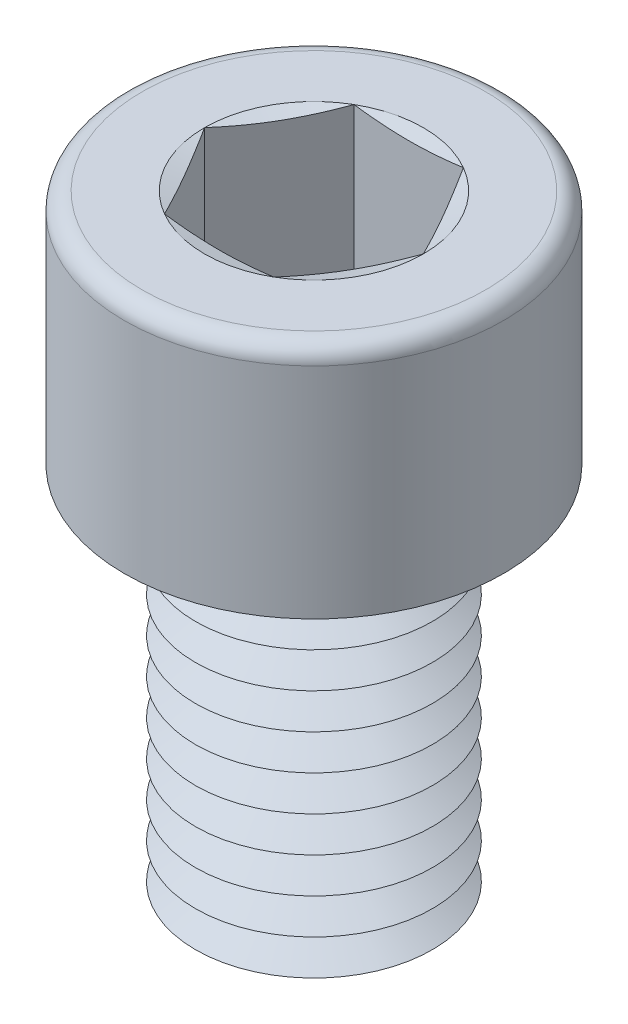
ISO-10303-21;
HEADER;
FILE_DESCRIPTION(('STEP AP214'),'2;1');
FILE_NAME('part.step','',(''),(''),'','','');
FILE_SCHEMA(('AUTOMOTIVE_DESIGN { 1 0 10303 214 1 1 1 1 }'));
ENDSEC;
DATA;
#1=APPLICATION_CONTEXT('core data for automotive mechanical design processes');
#2=APPLICATION_PROTOCOL_DEFINITION('international standard','automotive_design',2000,#1);
#3=PRODUCT_CONTEXT('',#1,'mechanical');
#4=PRODUCT('Part','Part','',(#3));
#5=PRODUCT_RELATED_PRODUCT_CATEGORY('part','',(#4));
#6=PRODUCT_DEFINITION_FORMATION('','',#4);
#7=PRODUCT_DEFINITION_CONTEXT('part definition',#1,'design');
#8=PRODUCT_DEFINITION('design','',#6,#7);
#9=PRODUCT_DEFINITION_SHAPE('','',#8);
#10=(LENGTH_UNIT() NAMED_UNIT(*) SI_UNIT(.MILLI.,.METRE.));
#11=(NAMED_UNIT(*) PLANE_ANGLE_UNIT() SI_UNIT($,.RADIAN.));
#12=(NAMED_UNIT(*) SI_UNIT($,.STERADIAN.) SOLID_ANGLE_UNIT());
#13=UNCERTAINTY_MEASURE_WITH_UNIT(LENGTH_MEASURE(1.E-05),#10,'distance_accuracy_value','');
#14=(GEOMETRIC_REPRESENTATION_CONTEXT(3) GLOBAL_UNCERTAINTY_ASSIGNED_CONTEXT((#13)) GLOBAL_UNIT_ASSIGNED_CONTEXT((#10,
#11,#12)) REPRESENTATION_CONTEXT('',''));
#15=CARTESIAN_POINT('',(0.,0.,0.));
#16=DIRECTION('',(0.,0.,1.));
#17=DIRECTION('',(1.,0.,0.));
#18=AXIS2_PLACEMENT_3D('',#15,#16,#17);
#19=CARTESIAN_POINT('',(0.,6.,0.));
#20=DIRECTION('',(0.,1.,0.));
#21=DIRECTION('',(0.,0.,1.));
#22=AXIS2_PLACEMENT_3D('',#19,#20,#21);
#23=CONICAL_SURFACE('',#22,3.70096189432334,1.0471975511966);
#24=CARTESIAN_POINT('',(0.,6.75,0.));
#25=DIRECTION('',(0.,1.,0.));
#26=DIRECTION('',(0.,0.,1.));
#27=AXIS2_PLACEMENT_3D('',#24,#25,#26);
#28=CIRCLE('',#27,5.);
#29=CARTESIAN_POINT('',(0.,6.75,5.));
#30=VERTEX_POINT('',#29);
#31=EDGE_CURVE('E399',#30,#30,#28,.T.);
#32=ORIENTED_EDGE('',*,*,#31,.F.);
#33=EDGE_LOOP('',(#32));
#34=FACE_BOUND('',#33,.T.);
#35=CARTESIAN_POINT('',(0.,6.,0.));
#36=DIRECTION('',(0.,1.,0.));
#37=DIRECTION('',(0.,0.,1.));
#38=AXIS2_PLACEMENT_3D('',#35,#36,#37);
#39=CIRCLE('',#38,3.70096189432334);
#40=CARTESIAN_POINT('',(0.,6.,3.70096189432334));
#41=VERTEX_POINT('',#40);
#42=EDGE_CURVE('E403',#41,#41,#39,.T.);
#43=ORIENTED_EDGE('',*,*,#42,.T.);
#44=EDGE_LOOP('',(#43));
#45=FACE_BOUND('',#44,.T.);
#46=ADVANCED_FACE('F41',(#34,#45),#23,.T.);
#47=CARTESIAN_POINT('',(0.,5.25,0.));
#48=DIRECTION('',(0.,-1.,0.));
#49=DIRECTION('',(0.,0.,-1.));
#50=AXIS2_PLACEMENT_3D('',#47,#48,#49);
#51=CONICAL_SURFACE('',#50,5.,1.0471975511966);
#52=ORIENTED_EDGE('',*,*,#42,.F.);
#53=EDGE_LOOP('',(#52));
#54=FACE_BOUND('',#53,.T.);
#55=CARTESIAN_POINT('',(0.,5.25,0.));
#56=DIRECTION('',(0.,1.,0.));
#57=DIRECTION('',(0.,0.,1.));
#58=AXIS2_PLACEMENT_3D('',#55,#56,#57);
#59=CIRCLE('',#58,5.);
#60=CARTESIAN_POINT('',(0.,5.25,5.));
#61=VERTEX_POINT('',#60);
#62=EDGE_CURVE('E407',#61,#61,#59,.T.);
#63=ORIENTED_EDGE('',*,*,#62,.T.);
#64=EDGE_LOOP('',(#63));
#65=FACE_BOUND('',#64,.T.);
#66=ADVANCED_FACE('F250',(#54,#65),#51,.T.);
#67=CARTESIAN_POINT('',(0.,0.,0.));
#68=DIRECTION('',(0.,1.,0.));
#69=DIRECTION('',(0.,0.,1.));
#70=AXIS2_PLACEMENT_3D('',#67,#68,#69);
#71=PLANE('',#70);
#72=CARTESIAN_POINT('',(0.,0.,0.));
#73=DIRECTION('',(0.,1.,0.));
#74=DIRECTION('',(0.,0.,1.));
#75=AXIS2_PLACEMENT_3D('',#72,#73,#74);
#76=CIRCLE('',#75,3.70096189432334);
#77=CARTESIAN_POINT('',(0.,0.,3.70096189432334));
#78=VERTEX_POINT('',#77);
#79=EDGE_CURVE('E434',#78,#78,#76,.T.);
#80=ORIENTED_EDGE('',*,*,#79,.F.);
#81=EDGE_LOOP('',(#80));
#82=FACE_BOUND('',#81,.T.);
#83=ADVANCED_FACE('F247',(#82),#71,.F.);
#84=CARTESIAN_POINT('',(0.,0.,0.));
#85=DIRECTION('',(0.,1.,0.));
#86=DIRECTION('',(0.,0.,1.));
#87=AXIS2_PLACEMENT_3D('',#84,#85,#86);
#88=CONICAL_SURFACE('',#87,3.70096189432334,1.0471975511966);
#89=CARTESIAN_POINT('',(0.,0.749999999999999,0.));
#90=DIRECTION('',(0.,1.,0.));
#91=DIRECTION('',(0.,0.,1.));
#92=AXIS2_PLACEMENT_3D('',#89,#90,#91);
#93=CIRCLE('',#92,5.);
#94=CARTESIAN_POINT('',(0.,0.749999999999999,5.));
#95=VERTEX_POINT('',#94);
#96=EDGE_CURVE('E430',#95,#95,#93,.T.);
#97=ORIENTED_EDGE('',*,*,#96,.F.);
#98=EDGE_LOOP('',(#97));
#99=FACE_BOUND('',#98,.T.);
#100=ORIENTED_EDGE('',*,*,#79,.T.);
#101=EDGE_LOOP('',(#100));
#102=FACE_BOUND('',#101,.T.);
#103=ADVANCED_FACE('F249',(#99,#102),#88,.T.);
#104=CARTESIAN_POINT('',(0.,0.749999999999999,0.));
#105=DIRECTION('',(0.,-1.,0.));
#106=DIRECTION('',(0.,0.,-1.));
#107=AXIS2_PLACEMENT_3D('',#104,#105,#106);
#108=CONICAL_SURFACE('',#107,5.,1.0471975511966);
#109=CARTESIAN_POINT('',(0.,1.5,0.));
#110=DIRECTION('',(0.,1.,0.));
#111=DIRECTION('',(0.,0.,1.));
#112=AXIS2_PLACEMENT_3D('',#109,#110,#111);
#113=CIRCLE('',#112,3.70096189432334);
#114=CARTESIAN_POINT('',(0.,1.5,3.70096189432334));
#115=VERTEX_POINT('',#114);
#116=EDGE_CURVE('E426',#115,#115,#113,.T.);
#117=ORIENTED_EDGE('',*,*,#116,.F.);
#118=EDGE_LOOP('',(#117));
#119=FACE_BOUND('',#118,.T.);
#120=ORIENTED_EDGE('',*,*,#96,.T.);
#121=EDGE_LOOP('',(#120));
#122=FACE_BOUND('',#121,.T.);
#123=ADVANCED_FACE('F290',(#119,#122),#108,.T.);
#124=CARTESIAN_POINT('',(0.,1.5,0.));
#125=DIRECTION('',(0.,1.,0.));
#126=DIRECTION('',(0.,0.,1.));
#127=AXIS2_PLACEMENT_3D('',#124,#125,#126);
#128=CONICAL_SURFACE('',#127,3.70096189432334,1.0471975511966);
#129=CARTESIAN_POINT('',(0.,2.25,0.));
#130=DIRECTION('',(0.,1.,0.));
#131=DIRECTION('',(0.,0.,1.));
#132=AXIS2_PLACEMENT_3D('',#129,#130,#131);
#133=CIRCLE('',#132,5.);
#134=CARTESIAN_POINT('',(0.,2.25,5.));
#135=VERTEX_POINT('',#134);
#136=EDGE_CURVE('E422',#135,#135,#133,.T.);
#137=ORIENTED_EDGE('',*,*,#136,.F.);
#138=EDGE_LOOP('',(#137));
#139=FACE_BOUND('',#138,.T.);
#140=ORIENTED_EDGE('',*,*,#116,.T.);
#141=EDGE_LOOP('',(#140));
#142=FACE_BOUND('',#141,.T.);
#143=ADVANCED_FACE('F285',(#139,#142),#128,.T.);
#144=CARTESIAN_POINT('',(0.,2.25,0.));
#145=DIRECTION('',(0.,-1.,0.));
#146=DIRECTION('',(0.,0.,-1.));
#147=AXIS2_PLACEMENT_3D('',#144,#145,#146);
#148=CONICAL_SURFACE('',#147,5.,1.0471975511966);
#149=CARTESIAN_POINT('',(0.,3.,0.));
#150=DIRECTION('',(0.,1.,0.));
#151=DIRECTION('',(0.,0.,1.));
#152=AXIS2_PLACEMENT_3D('',#149,#150,#151);
#153=CIRCLE('',#152,3.70096189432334);
#154=CARTESIAN_POINT('',(0.,3.,3.70096189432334));
#155=VERTEX_POINT('',#154);
#156=EDGE_CURVE('E418',#155,#155,#153,.T.);
#157=ORIENTED_EDGE('',*,*,#156,.F.);
#158=EDGE_LOOP('',(#157));
#159=FACE_BOUND('',#158,.T.);
#160=ORIENTED_EDGE('',*,*,#136,.T.);
#161=EDGE_LOOP('',(#160));
#162=FACE_BOUND('',#161,.T.);
#163=ADVANCED_FACE('F282',(#159,#162),#148,.T.);
#164=CARTESIAN_POINT('',(0.,3.,0.));
#165=DIRECTION('',(0.,1.,0.));
#166=DIRECTION('',(0.,0.,1.));
#167=AXIS2_PLACEMENT_3D('',#164,#165,#166);
#168=CONICAL_SURFACE('',#167,3.70096189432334,1.0471975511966);
#169=CARTESIAN_POINT('',(0.,3.75,0.));
#170=DIRECTION('',(0.,1.,0.));
#171=DIRECTION('',(0.,0.,1.));
#172=AXIS2_PLACEMENT_3D('',#169,#170,#171);
#173=CIRCLE('',#172,5.);
#174=CARTESIAN_POINT('',(0.,3.75,5.));
#175=VERTEX_POINT('',#174);
#176=EDGE_CURVE('E415',#175,#175,#173,.T.);
#177=ORIENTED_EDGE('',*,*,#176,.F.);
#178=EDGE_LOOP('',(#177));
#179=FACE_BOUND('',#178,.T.);
#180=ORIENTED_EDGE('',*,*,#156,.T.);
#181=EDGE_LOOP('',(#180));
#182=FACE_BOUND('',#181,.T.);
#183=ADVANCED_FACE('F276',(#179,#182),#168,.T.);
#184=CARTESIAN_POINT('',(0.,3.75,0.));
#185=DIRECTION('',(0.,-1.,0.));
#186=DIRECTION('',(0.,0.,-1.));
#187=AXIS2_PLACEMENT_3D('',#184,#185,#186);
#188=CONICAL_SURFACE('',#187,5.,1.0471975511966);
#189=CARTESIAN_POINT('',(0.,4.5,0.));
#190=DIRECTION('',(0.,1.,0.));
#191=DIRECTION('',(0.,0.,1.));
#192=AXIS2_PLACEMENT_3D('',#189,#190,#191);
#193=CIRCLE('',#192,3.70096189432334);
#194=CARTESIAN_POINT('',(0.,4.5,3.70096189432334));
#195=VERTEX_POINT('',#194);
#196=EDGE_CURVE('E411',#195,#195,#193,.T.);
#197=ORIENTED_EDGE('',*,*,#196,.F.);
#198=EDGE_LOOP('',(#197));
#199=FACE_BOUND('',#198,.T.);
#200=ORIENTED_EDGE('',*,*,#176,.T.);
#201=EDGE_LOOP('',(#200));
#202=FACE_BOUND('',#201,.T.);
#203=ADVANCED_FACE('F272',(#199,#202),#188,.T.);
#204=CARTESIAN_POINT('',(0.,4.5,0.));
#205=DIRECTION('',(0.,1.,0.));
#206=DIRECTION('',(0.,0.,1.));
#207=AXIS2_PLACEMENT_3D('',#204,#205,#206);
#208=CONICAL_SURFACE('',#207,3.70096189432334,1.0471975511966);
#209=ORIENTED_EDGE('',*,*,#62,.F.);
#210=EDGE_LOOP('',(#209));
#211=FACE_BOUND('',#210,.T.);
#212=ORIENTED_EDGE('',*,*,#196,.T.);
#213=EDGE_LOOP('',(#212));
#214=FACE_BOUND('',#213,.T.);
#215=ADVANCED_FACE('F275',(#211,#214),#208,.T.);
#216=CARTESIAN_POINT('',(0.,7.5,0.));
#217=DIRECTION('',(0.,1.,0.));
#218=DIRECTION('',(0.,0.,1.));
#219=AXIS2_PLACEMENT_3D('',#216,#217,#218);
#220=CONICAL_SURFACE('',#219,3.70096189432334,1.0471975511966);
#221=CARTESIAN_POINT('',(0.,8.25,0.));
#222=DIRECTION('',(0.,1.,0.));
#223=DIRECTION('',(0.,0.,1.));
#224=AXIS2_PLACEMENT_3D('',#221,#222,#223);
#225=CIRCLE('',#224,5.);
#226=CARTESIAN_POINT('',(0.,8.25,5.));
#227=VERTEX_POINT('',#226);
#228=EDGE_CURVE('E391',#227,#227,#225,.T.);
#229=ORIENTED_EDGE('',*,*,#228,.F.);
#230=EDGE_LOOP('',(#229));
#231=FACE_BOUND('',#230,.T.);
#232=CARTESIAN_POINT('',(0.,7.5,0.));
#233=DIRECTION('',(0.,1.,0.));
#234=DIRECTION('',(0.,0.,1.));
#235=AXIS2_PLACEMENT_3D('',#232,#233,#234);
#236=CIRCLE('',#235,3.70096189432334);
#237=CARTESIAN_POINT('',(0.,7.5,3.70096189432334));
#238=VERTEX_POINT('',#237);
#239=EDGE_CURVE('E395',#238,#238,#236,.T.);
#240=ORIENTED_EDGE('',*,*,#239,.T.);
#241=EDGE_LOOP('',(#240));
#242=FACE_BOUND('',#241,.T.);
#243=ADVANCED_FACE('F280',(#231,#242),#220,.T.);
#244=CARTESIAN_POINT('',(0.,6.75,0.));
#245=DIRECTION('',(0.,-1.,0.));
#246=DIRECTION('',(0.,0.,-1.));
#247=AXIS2_PLACEMENT_3D('',#244,#245,#246);
#248=CONICAL_SURFACE('',#247,5.,1.0471975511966);
#249=ORIENTED_EDGE('',*,*,#239,.F.);
#250=EDGE_LOOP('',(#249));
#251=FACE_BOUND('',#250,.T.);
#252=ORIENTED_EDGE('',*,*,#31,.T.);
#253=EDGE_LOOP('',(#252));
#254=FACE_BOUND('',#253,.T.);
#255=ADVANCED_FACE('F674',(#251,#254),#248,.T.);
#256=CARTESIAN_POINT('',(0.,9.,0.));
#257=DIRECTION('',(0.,1.,0.));
#258=DIRECTION('',(0.,0.,1.));
#259=AXIS2_PLACEMENT_3D('',#256,#257,#258);
#260=CONICAL_SURFACE('',#259,3.70096189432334,1.0471975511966);
#261=CARTESIAN_POINT('',(0.,9.75,0.));
#262=DIRECTION('',(0.,1.,0.));
#263=DIRECTION('',(0.,0.,1.));
#264=AXIS2_PLACEMENT_3D('',#261,#262,#263);
#265=CIRCLE('',#264,5.);
#266=CARTESIAN_POINT('',(0.,9.75,5.));
#267=VERTEX_POINT('',#266);
#268=EDGE_CURVE('E383',#267,#267,#265,.T.);
#269=ORIENTED_EDGE('',*,*,#268,.F.);
#270=EDGE_LOOP('',(#269));
#271=FACE_BOUND('',#270,.T.);
#272=CARTESIAN_POINT('',(0.,9.,0.));
#273=DIRECTION('',(0.,1.,0.));
#274=DIRECTION('',(0.,0.,1.));
#275=AXIS2_PLACEMENT_3D('',#272,#273,#274);
#276=CIRCLE('',#275,3.70096189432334);
#277=CARTESIAN_POINT('',(0.,9.,3.70096189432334));
#278=VERTEX_POINT('',#277);
#279=EDGE_CURVE('E387',#278,#278,#276,.T.);
#280=ORIENTED_EDGE('',*,*,#279,.T.);
#281=EDGE_LOOP('',(#280));
#282=FACE_BOUND('',#281,.T.);
#283=ADVANCED_FACE('F683',(#271,#282),#260,.T.);
#284=CARTESIAN_POINT('',(0.,8.25,0.));
#285=DIRECTION('',(0.,-1.,0.));
#286=DIRECTION('',(0.,0.,-1.));
#287=AXIS2_PLACEMENT_3D('',#284,#285,#286);
#288=CONICAL_SURFACE('',#287,5.,1.0471975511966);
#289=ORIENTED_EDGE('',*,*,#279,.F.);
#290=EDGE_LOOP('',(#289));
#291=FACE_BOUND('',#290,.T.);
#292=ORIENTED_EDGE('',*,*,#228,.T.);
#293=EDGE_LOOP('',(#292));
#294=FACE_BOUND('',#293,.T.);
#295=ADVANCED_FACE('F693',(#291,#294),#288,.T.);
#296=CARTESIAN_POINT('',(0.,10.5,0.));
#297=DIRECTION('',(0.,1.,0.));
#298=DIRECTION('',(0.,0.,1.));
#299=AXIS2_PLACEMENT_3D('',#296,#297,#298);
#300=CONICAL_SURFACE('',#299,3.70096189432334,1.0471975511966);
#301=CARTESIAN_POINT('',(0.,11.25,0.));
#302=DIRECTION('',(0.,1.,0.));
#303=DIRECTION('',(0.,0.,1.));
#304=AXIS2_PLACEMENT_3D('',#301,#302,#303);
#305=CIRCLE('',#304,5.);
#306=CARTESIAN_POINT('',(0.,11.25,5.));
#307=VERTEX_POINT('',#306);
#308=EDGE_CURVE('E375',#307,#307,#305,.T.);
#309=ORIENTED_EDGE('',*,*,#308,.F.);
#310=EDGE_LOOP('',(#309));
#311=FACE_BOUND('',#310,.T.);
#312=CARTESIAN_POINT('',(0.,10.5,0.));
#313=DIRECTION('',(0.,1.,0.));
#314=DIRECTION('',(0.,0.,1.));
#315=AXIS2_PLACEMENT_3D('',#312,#313,#314);
#316=CIRCLE('',#315,3.70096189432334);
#317=CARTESIAN_POINT('',(0.,10.5,3.70096189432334));
#318=VERTEX_POINT('',#317);
#319=EDGE_CURVE('E379',#318,#318,#316,.T.);
#320=ORIENTED_EDGE('',*,*,#319,.T.);
#321=EDGE_LOOP('',(#320));
#322=FACE_BOUND('',#321,.T.);
#323=ADVANCED_FACE('F703',(#311,#322),#300,.T.);
#324=CARTESIAN_POINT('',(0.,9.75,0.));
#325=DIRECTION('',(0.,-1.,0.));
#326=DIRECTION('',(0.,0.,-1.));
#327=AXIS2_PLACEMENT_3D('',#324,#325,#326);
#328=CONICAL_SURFACE('',#327,5.,1.0471975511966);
#329=ORIENTED_EDGE('',*,*,#319,.F.);
#330=EDGE_LOOP('',(#329));
#331=FACE_BOUND('',#330,.T.);
#332=ORIENTED_EDGE('',*,*,#268,.T.);
#333=EDGE_LOOP('',(#332));
#334=FACE_BOUND('',#333,.T.);
#335=ADVANCED_FACE('F713',(#331,#334),#328,.T.);
#336=CARTESIAN_POINT('',(0.,12.,0.));
#337=DIRECTION('',(0.,1.,0.));
#338=DIRECTION('',(0.,0.,1.));
#339=AXIS2_PLACEMENT_3D('',#336,#337,#338);
#340=CONICAL_SURFACE('',#339,3.70096189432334,1.0471975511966);
#341=CARTESIAN_POINT('',(0.,12.75,0.));
#342=DIRECTION('',(0.,1.,0.));
#343=DIRECTION('',(0.,0.,1.));
#344=AXIS2_PLACEMENT_3D('',#341,#342,#343);
#345=CIRCLE('',#344,5.);
#346=CARTESIAN_POINT('',(0.,12.75,5.));
#347=VERTEX_POINT('',#346);
#348=EDGE_CURVE('E367',#347,#347,#345,.T.);
#349=ORIENTED_EDGE('',*,*,#348,.F.);
#350=EDGE_LOOP('',(#349));
#351=FACE_BOUND('',#350,.T.);
#352=CARTESIAN_POINT('',(0.,12.,0.));
#353=DIRECTION('',(0.,1.,0.));
#354=DIRECTION('',(0.,0.,1.));
#355=AXIS2_PLACEMENT_3D('',#352,#353,#354);
#356=CIRCLE('',#355,3.70096189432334);
#357=CARTESIAN_POINT('',(0.,12.,3.70096189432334));
#358=VERTEX_POINT('',#357);
#359=EDGE_CURVE('E371',#358,#358,#356,.T.);
#360=ORIENTED_EDGE('',*,*,#359,.T.);
#361=EDGE_LOOP('',(#360));
#362=FACE_BOUND('',#361,.T.);
#363=ADVANCED_FACE('F723',(#351,#362),#340,.T.);
#364=CARTESIAN_POINT('',(0.,11.25,0.));
#365=DIRECTION('',(0.,-1.,0.));
#366=DIRECTION('',(0.,0.,-1.));
#367=AXIS2_PLACEMENT_3D('',#364,#365,#366);
#368=CONICAL_SURFACE('',#367,5.,1.0471975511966);
#369=ORIENTED_EDGE('',*,*,#359,.F.);
#370=EDGE_LOOP('',(#369));
#371=FACE_BOUND('',#370,.T.);
#372=ORIENTED_EDGE('',*,*,#308,.T.);
#373=EDGE_LOOP('',(#372));
#374=FACE_BOUND('',#373,.T.);
#375=ADVANCED_FACE('F733',(#371,#374),#368,.T.);
#376=CARTESIAN_POINT('',(0.,13.5,0.));
#377=DIRECTION('',(0.,1.,0.));
#378=DIRECTION('',(0.,0.,1.));
#379=AXIS2_PLACEMENT_3D('',#376,#377,#378);
#380=CONICAL_SURFACE('',#379,3.70096189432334,1.0471975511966);
#381=CARTESIAN_POINT('',(0.,14.25,0.));
#382=DIRECTION('',(0.,1.,0.));
#383=DIRECTION('',(0.,0.,1.));
#384=AXIS2_PLACEMENT_3D('',#381,#382,#383);
#385=CIRCLE('',#384,5.);
#386=CARTESIAN_POINT('',(0.,14.25,5.));
#387=VERTEX_POINT('',#386);
#388=EDGE_CURVE('E352',#387,#387,#385,.T.);
#389=ORIENTED_EDGE('',*,*,#388,.F.);
#390=EDGE_LOOP('',(#389));
#391=FACE_BOUND('',#390,.T.);
#392=CARTESIAN_POINT('',(0.,13.5,0.));
#393=DIRECTION('',(0.,1.,0.));
#394=DIRECTION('',(0.,0.,1.));
#395=AXIS2_PLACEMENT_3D('',#392,#393,#394);
#396=CIRCLE('',#395,3.70096189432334);
#397=CARTESIAN_POINT('',(0.,13.5,3.70096189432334));
#398=VERTEX_POINT('',#397);
#399=EDGE_CURVE('E363',#398,#398,#396,.T.);
#400=ORIENTED_EDGE('',*,*,#399,.T.);
#401=EDGE_LOOP('',(#400));
#402=FACE_BOUND('',#401,.T.);
#403=ADVANCED_FACE('F743',(#391,#402),#380,.T.);
#404=CARTESIAN_POINT('',(0.,12.75,0.));
#405=DIRECTION('',(0.,-1.,0.));
#406=DIRECTION('',(0.,0.,-1.));
#407=AXIS2_PLACEMENT_3D('',#404,#405,#406);
#408=CONICAL_SURFACE('',#407,5.,1.0471975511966);
#409=ORIENTED_EDGE('',*,*,#399,.F.);
#410=EDGE_LOOP('',(#409));
#411=FACE_BOUND('',#410,.T.);
#412=ORIENTED_EDGE('',*,*,#348,.T.);
#413=EDGE_LOOP('',(#412));
#414=FACE_BOUND('',#413,.T.);
#415=ADVANCED_FACE('F753',(#411,#414),#408,.T.);
#416=CARTESIAN_POINT('',(0.,15.,0.));
#417=DIRECTION('',(0.,1.,0.));
#418=DIRECTION('',(0.,0.,1.));
#419=AXIS2_PLACEMENT_3D('',#416,#417,#418);
#420=CONICAL_SURFACE('',#419,3.70096189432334,1.0471975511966);
#421=CARTESIAN_POINT('',(0.,15.75,0.));
#422=DIRECTION('',(0.,1.,0.));
#423=DIRECTION('',(0.,0.,1.));
#424=AXIS2_PLACEMENT_3D('',#421,#422,#423);
#425=CIRCLE('',#424,5.);
#426=CARTESIAN_POINT('',(0.,15.75,5.));
#427=VERTEX_POINT('',#426);
#428=EDGE_CURVE('E358',#427,#427,#425,.T.);
#429=ORIENTED_EDGE('',*,*,#428,.F.);
#430=EDGE_LOOP('',(#429));
#431=FACE_BOUND('',#430,.T.);
#432=CARTESIAN_POINT('',(0.,15.,0.));
#433=DIRECTION('',(0.,1.,0.));
#434=DIRECTION('',(0.,0.,1.));
#435=AXIS2_PLACEMENT_3D('',#432,#433,#434);
#436=CIRCLE('',#435,3.70096189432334);
#437=CARTESIAN_POINT('',(0.,15.,3.70096189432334));
#438=VERTEX_POINT('',#437);
#439=EDGE_CURVE('E347',#438,#438,#436,.T.);
#440=ORIENTED_EDGE('',*,*,#439,.T.);
#441=EDGE_LOOP('',(#440));
#442=FACE_BOUND('',#441,.T.);
#443=ADVANCED_FACE('F763',(#431,#442),#420,.T.);
#444=CARTESIAN_POINT('',(0.,14.25,0.));
#445=DIRECTION('',(0.,-1.,0.));
#446=DIRECTION('',(0.,0.,-1.));
#447=AXIS2_PLACEMENT_3D('',#444,#445,#446);
#448=CONICAL_SURFACE('',#447,5.,1.0471975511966);
#449=ORIENTED_EDGE('',*,*,#439,.F.);
#450=EDGE_LOOP('',(#449));
#451=FACE_BOUND('',#450,.T.);
#452=ORIENTED_EDGE('',*,*,#388,.T.);
#453=EDGE_LOOP('',(#452));
#454=FACE_BOUND('',#453,.T.);
#455=ADVANCED_FACE('F194',(#451,#454),#448,.T.);
#456=CARTESIAN_POINT('',(0.,26.,0.));
#457=DIRECTION('',(0.,1.,0.));
#458=DIRECTION('',(0.,0.,1.));
#459=AXIS2_PLACEMENT_3D('',#456,#457,#458);
#460=PLANE('',#459);
#461=CARTESIAN_POINT('',(0.,26.,0.));
#462=DIRECTION('',(0.,1.,0.));
#463=DIRECTION('',(0.,0.,1.));
#464=AXIS2_PLACEMENT_3D('',#461,#462,#463);
#465=CIRCLE('',#464,4.61880215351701);
#466=CARTESIAN_POINT('',(2.3094010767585,26.,4.));
#467=VERTEX_POINT('',#466);
#468=CARTESIAN_POINT('',(4.61880215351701,26.,0.));
#469=VERTEX_POINT('',#468);
#470=EDGE_CURVE('E121',#467,#469,#465,.T.);
#471=ORIENTED_EDGE('',*,*,#470,.F.);
#472=CARTESIAN_POINT('',(0.,26.,0.));
#473=DIRECTION('',(0.,1.,0.));
#474=DIRECTION('',(0.,0.,1.));
#475=AXIS2_PLACEMENT_3D('',#472,#473,#474);
#476=CIRCLE('',#475,4.61880215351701);
#477=CARTESIAN_POINT('',(-2.3094010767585,26.,4.));
#478=VERTEX_POINT('',#477);
#479=EDGE_CURVE('E45',#478,#467,#476,.T.);
#480=ORIENTED_EDGE('',*,*,#479,.F.);
#481=CARTESIAN_POINT('',(-4.61880215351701,26.,0.));
#482=VERTEX_POINT('',#481);
#483=EDGE_CURVE('E138',#482,#478,#476,.T.);
#484=ORIENTED_EDGE('',*,*,#483,.F.);
#485=CARTESIAN_POINT('',(-2.3094010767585,26.,-4.));
#486=VERTEX_POINT('',#485);
#487=EDGE_CURVE('E508',#486,#482,#476,.T.);
#488=ORIENTED_EDGE('',*,*,#487,.F.);
#489=CARTESIAN_POINT('',(2.3094010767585,26.,-4.));
#490=VERTEX_POINT('',#489);
#491=EDGE_CURVE('E51',#490,#486,#476,.T.);
#492=ORIENTED_EDGE('',*,*,#491,.F.);
#493=EDGE_CURVE('E11',#469,#490,#476,.T.);
#494=ORIENTED_EDGE('',*,*,#493,.F.);
#495=EDGE_LOOP('',(#471,#480,#484,#488,#492,#494));
#496=FACE_BOUND('',#495,.T.);
#497=CARTESIAN_POINT('',(0.,26.,0.));
#498=DIRECTION('',(0.,1.,0.));
#499=DIRECTION('',(0.,0.,1.));
#500=AXIS2_PLACEMENT_3D('',#497,#498,#499);
#501=CIRCLE('',#500,7.25);
#502=CARTESIAN_POINT('',(0.,26.,7.25));
#503=VERTEX_POINT('',#502);
#504=EDGE_CURVE('E477',#503,#503,#501,.T.);
#505=ORIENTED_EDGE('',*,*,#504,.T.);
#506=EDGE_LOOP('',(#505));
#507=FACE_BOUND('',#506,.T.);
#508=ADVANCED_FACE('F140',(#496,#507),#460,.T.);
#509=CARTESIAN_POINT('',(0.,25.25,0.));
#510=DIRECTION('',(0.,1.,0.));
#511=DIRECTION('',(0.,0.,1.));
#512=AXIS2_PLACEMENT_3D('',#509,#510,#511);
#513=TOROIDAL_SURFACE('',#512,7.25,0.75);
#514=CARTESIAN_POINT('',(0.,25.25,0.));
#515=DIRECTION('',(0.,1.,0.));
#516=DIRECTION('',(0.,0.,1.));
#517=AXIS2_PLACEMENT_3D('',#514,#515,#516);
#518=CIRCLE('',#517,8.);
#519=CARTESIAN_POINT('',(0.,25.25,8.));
#520=VERTEX_POINT('',#519);
#521=EDGE_CURVE('E481',#520,#520,#518,.F.);
#522=ORIENTED_EDGE('',*,*,#521,.F.);
#523=EDGE_LOOP('',(#522));
#524=FACE_BOUND('',#523,.T.);
#525=ORIENTED_EDGE('',*,*,#504,.F.);
#526=EDGE_LOOP('',(#525));
#527=FACE_BOUND('',#526,.T.);
#528=ADVANCED_FACE('F43',(#524,#527),#513,.T.);
#529=CARTESIAN_POINT('',(0.,26.,0.));
#530=DIRECTION('',(0.,-1.,0.));
#531=DIRECTION('',(0.,0.,-1.));
#532=AXIS2_PLACEMENT_3D('',#529,#530,#531);
#533=CYLINDRICAL_SURFACE('',#532,8.);
#534=ORIENTED_EDGE('',*,*,#521,.T.);
#535=EDGE_LOOP('',(#534));
#536=FACE_BOUND('',#535,.T.);
#537=CARTESIAN_POINT('',(0.,16.,0.));
#538=DIRECTION('',(0.,1.,0.));
#539=DIRECTION('',(0.,0.,1.));
#540=AXIS2_PLACEMENT_3D('',#537,#538,#539);
#541=CIRCLE('',#540,8.);
#542=CARTESIAN_POINT('',(0.,16.,8.));
#543=VERTEX_POINT('',#542);
#544=EDGE_CURVE('E465',#543,#543,#541,.T.);
#545=ORIENTED_EDGE('',*,*,#544,.T.);
#546=EDGE_LOOP('',(#545));
#547=FACE_BOUND('',#546,.T.);
#548=ADVANCED_FACE('F242',(#536,#547),#533,.T.);
#549=CARTESIAN_POINT('',(0.,16.,0.));
#550=DIRECTION('',(0.,1.,0.));
#551=DIRECTION('',(0.,0.,1.));
#552=AXIS2_PLACEMENT_3D('',#549,#550,#551);
#553=PLANE('',#552);
#554=ORIENTED_EDGE('',*,*,#544,.F.);
#555=EDGE_LOOP('',(#554));
#556=FACE_BOUND('',#555,.T.);
#557=CARTESIAN_POINT('',(0.,16.,0.));
#558=DIRECTION('',(0.,1.,0.));
#559=DIRECTION('',(0.,0.,1.));
#560=AXIS2_PLACEMENT_3D('',#557,#558,#559);
#561=CIRCLE('',#560,5.);
#562=CARTESIAN_POINT('',(0.,16.,5.));
#563=VERTEX_POINT('',#562);
#564=EDGE_CURVE('E473',#563,#563,#561,.T.);
#565=ORIENTED_EDGE('',*,*,#564,.T.);
#566=EDGE_LOOP('',(#565));
#567=FACE_BOUND('',#566,.T.);
#568=ADVANCED_FACE('F238',(#556,#567),#553,.F.);
#569=CARTESIAN_POINT('',(0.,16.,0.));
#570=DIRECTION('',(0.,-1.,0.));
#571=DIRECTION('',(0.,0.,-1.));
#572=AXIS2_PLACEMENT_3D('',#569,#570,#571);
#573=CYLINDRICAL_SURFACE('',#572,5.);
#574=ORIENTED_EDGE('',*,*,#428,.T.);
#575=EDGE_LOOP('',(#574));
#576=FACE_BOUND('',#575,.T.);
#577=ORIENTED_EDGE('',*,*,#564,.F.);
#578=EDGE_LOOP('',(#577));
#579=FACE_BOUND('',#578,.T.);
#580=ADVANCED_FACE('F241',(#576,#579),#573,.T.);
#581=CARTESIAN_POINT('',(0.,26.,0.));
#582=DIRECTION('',(0.,1.,0.));
#583=DIRECTION('',(0.,0.,1.));
#584=AXIS2_PLACEMENT_3D('',#581,#582,#583);
#585=CONICAL_SURFACE('',#584,4.61880215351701,1.30899693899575);
#586=ORIENTED_EDGE('',*,*,#479,.T.);
#587=CARTESIAN_POINT('',(-6.02881516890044,26.7010337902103,4.));
#588=CARTESIAN_POINT('',(-5.8481958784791,26.6607170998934,4.));
#589=CARTESIAN_POINT('',(-5.66746141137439,26.6209072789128,4.));
#590=CARTESIAN_POINT('',(-5.30570552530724,26.5425748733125,4.));
#591=CARTESIAN_POINT('',(-5.12468409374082,26.5040523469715,4.));
#592=CARTESIAN_POINT('',(-4.76212658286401,26.4285326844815,4.));
#593=CARTESIAN_POINT('',(-4.58059016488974,26.3915371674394,4.));
#594=CARTESIAN_POINT('',(-4.21713405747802,26.3194839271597,4.));
#595=CARTESIAN_POINT('',(-4.03521437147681,26.2844261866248,4.));
#596=CARTESIAN_POINT('',(-3.67250657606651,26.217001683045,4.));
#597=CARTESIAN_POINT('',(-3.49172236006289,26.1846141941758,4.));
#598=CARTESIAN_POINT('',(-3.12965653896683,26.1227577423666,4.));
#599=CARTESIAN_POINT('',(-2.94837492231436,26.093288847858,4.));
#600=CARTESIAN_POINT('',(-2.40374454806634,26.0102645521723,4.));
#601=CARTESIAN_POINT('',(-2.03952090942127,25.9620742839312,4.));
#602=CARTESIAN_POINT('',(-1.48950033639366,25.905182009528,4.));
#603=CARTESIAN_POINT('',(-1.30450135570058,25.8887355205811,4.));
#604=CARTESIAN_POINT('',(-0.93405305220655,25.861988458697,4.));
#605=CARTESIAN_POINT('',(-0.748603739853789,25.8516877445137,4.));
#606=CARTESIAN_POINT('',(-0.37752889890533,25.8378309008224,4.));
#607=CARTESIAN_POINT('',(-0.191903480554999,25.834271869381,4.));
#608=CARTESIAN_POINT('',(0.179350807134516,25.8341156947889,4.));
#609=CARTESIAN_POINT('',(0.364979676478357,25.8375185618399,4.));
#610=CARTESIAN_POINT('',(0.736742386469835,25.8510980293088,4.));
#611=CARTESIAN_POINT('',(0.922875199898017,25.8613021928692,4.));
#612=CARTESIAN_POINT('',(1.29469888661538,25.8879135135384,4.));
#613=CARTESIAN_POINT('',(1.48038973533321,25.9043210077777,4.));
#614=CARTESIAN_POINT('',(1.85132520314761,25.942529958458,4.));
#615=CARTESIAN_POINT('',(2.036569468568,25.9643347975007,4.));
#616=CARTESIAN_POINT('',(2.40646407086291,26.0124559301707,4.));
#617=CARTESIAN_POINT('',(2.59111440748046,26.0387722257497,4.));
#618=CARTESIAN_POINT('',(2.96467049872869,26.0958323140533,4.));
#619=CARTESIAN_POINT('',(3.15356118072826,26.1266739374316,4.));
#620=CARTESIAN_POINT('',(3.53080577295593,26.1914895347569,4.));
#621=CARTESIAN_POINT('',(3.71915966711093,26.225463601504,4.));
#622=CARTESIAN_POINT('',(4.2835627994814,26.331122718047,4.));
#623=CARTESIAN_POINT('',(4.65891157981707,26.4065379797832,4.));
#624=CARTESIAN_POINT('',(5.40835351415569,26.5637698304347,4.));
#625=CARTESIAN_POINT('',(5.78244627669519,26.6455882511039,4.));
#626=CARTESIAN_POINT('',(6.52968076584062,26.8134827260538,4.));
#627=CARTESIAN_POINT('',(6.90282246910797,26.8995588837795,4.));
#628=CARTESIAN_POINT('',(7.64386653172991,27.0735615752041,4.));
#629=CARTESIAN_POINT('',(8.01177724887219,27.1614526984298,4.));
#630=CARTESIAN_POINT('',(8.74711499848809,27.3392675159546,4.));
#631=CARTESIAN_POINT('',(9.11454201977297,27.4291912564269,4.));
#632=CARTESIAN_POINT('',(9.84851788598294,27.6103931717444,4.));
#633=CARTESIAN_POINT('',(10.2150672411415,27.7016692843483,4.));
#634=CARTESIAN_POINT('',(10.9478692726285,27.8853497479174,4.));
#635=CARTESIAN_POINT('',(11.3141219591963,27.977754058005,4.));
#636=CARTESIAN_POINT('',(11.6802738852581,28.0705515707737,4.));
#637=B_SPLINE_CURVE_WITH_KNOTS('',3,(#587,#588,#589,#590,#591,#592,#593,#594,#595,#596,#597,
#598,#599,#600,#601,#602,#603,#604,#605,#606,#607,#608,#609,#610,#611,#612,#613,#614,#615,#616,
#617,#618,#619,#620,#621,#622,#623,#624,#625,#626,#627,#628,#629,#630,#631,#632,#633,#634,#635,
#636),.UNSPECIFIED.,.F.,.F.,(4,2,2,2,2,2,2,2,2,2,2,2,2,2,2,2,2,2,2,2,2,2,2,2,4),(0.,
0.555194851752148,1.11041480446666,1.66620908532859,2.22199840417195,2.77296094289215,
3.32393639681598,4.42561440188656,4.98271716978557,5.5398071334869,6.09665724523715,
6.65350817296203,7.21262964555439,7.77178150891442,8.33128469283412,8.89078811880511,
9.46493123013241,10.0390913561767,11.1875388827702,12.3363161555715,13.4851213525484,
14.6199040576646,15.7547125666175,16.8879395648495,18.0211256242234),.UNSPECIFIED.);
#638=EDGE_CURVE('E127',#478,#467,#637,.T.);
#639=ORIENTED_EDGE('',*,*,#638,.F.);
#640=EDGE_LOOP('',(#586,#639));
#641=FACE_BOUND('',#640,.T.);
#642=ADVANCED_FACE('F132',(#641),#585,.F.);
#643=ORIENTED_EDGE('',*,*,#483,.T.);
#644=CARTESIAN_POINT('',(-4.61891762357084,26.0000309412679,-0.000199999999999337));
#645=CARTESIAN_POINT('',(-4.52300443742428,25.9743194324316,0.165926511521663));
#646=CARTESIAN_POINT('',(-4.42691734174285,25.9509775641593,0.332354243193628));
#647=CARTESIAN_POINT('',(-4.23440378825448,25.9099680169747,0.66579749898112));
#648=CARTESIAN_POINT('',(-4.13797720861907,25.8923026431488,0.832813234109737));
#649=CARTESIAN_POINT('',(-3.94536936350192,25.8636774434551,1.16641980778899));
#650=CARTESIAN_POINT('',(-3.84918940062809,25.8526834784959,1.33300839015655));
#651=CARTESIAN_POINT('',(-3.65670681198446,25.8379416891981,1.66639801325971));
#652=CARTESIAN_POINT('',(-3.5604042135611,25.8341924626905,1.83319900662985));
#653=CARTESIAN_POINT('',(-3.3677990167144,25.8341924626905,2.16680099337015));
#654=CARTESIAN_POINT('',(-3.27149641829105,25.8379416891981,2.33360198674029));
#655=CARTESIAN_POINT('',(-3.07901382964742,25.8526834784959,2.66699160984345));
#656=CARTESIAN_POINT('',(-2.98283386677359,25.8636774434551,2.83358019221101));
#657=CARTESIAN_POINT('',(-2.79022602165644,25.8923026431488,3.16718676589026));
#658=CARTESIAN_POINT('',(-2.69379944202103,25.9099680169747,3.33420250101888));
#659=CARTESIAN_POINT('',(-2.50128588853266,25.9509775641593,3.66764575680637));
#660=CARTESIAN_POINT('',(-2.40519879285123,25.9743194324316,3.83407348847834));
#661=CARTESIAN_POINT('',(-2.30928560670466,26.0000309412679,4.0002));
#662=B_SPLINE_CURVE_WITH_KNOTS('',3,(#644,#645,#646,#647,#648,#649,#650,#651,#652,#653,#654,
#655,#656,#657,#658,#659,#660,#661),.UNSPECIFIED.,.F.,.F.,(4,2,2,2,2,2,2,2,4),(0.,
0.580655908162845,1.1615473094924,1.73944052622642,2.31722188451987,2.89500324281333,
3.47289645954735,4.0537878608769,4.63444376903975),.UNSPECIFIED.);
#663=EDGE_CURVE('E163',#482,#478,#662,.T.);
#664=ORIENTED_EDGE('',*,*,#663,.F.);
#665=EDGE_LOOP('',(#643,#664));
#666=FACE_BOUND('',#665,.T.);
#667=ADVANCED_FACE('F257',(#666),#585,.F.);
#668=ORIENTED_EDGE('',*,*,#487,.T.);
#669=CARTESIAN_POINT('',(-2.30928560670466,26.0000309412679,-4.0002));
#670=CARTESIAN_POINT('',(-2.40519879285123,25.9743194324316,-3.83407348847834));
#671=CARTESIAN_POINT('',(-2.50128588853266,25.9509775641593,-3.66764575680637));
#672=CARTESIAN_POINT('',(-2.69379944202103,25.9099680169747,-3.33420250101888));
#673=CARTESIAN_POINT('',(-2.79022602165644,25.8923026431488,-3.16718676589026));
#674=CARTESIAN_POINT('',(-2.98283386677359,25.8636774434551,-2.83358019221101));
#675=CARTESIAN_POINT('',(-3.07901382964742,25.8526834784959,-2.66699160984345));
#676=CARTESIAN_POINT('',(-3.27149641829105,25.8379416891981,-2.33360198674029));
#677=CARTESIAN_POINT('',(-3.3677990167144,25.8341924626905,-2.16680099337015));
#678=CARTESIAN_POINT('',(-3.5604042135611,25.8341924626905,-1.83319900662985));
#679=CARTESIAN_POINT('',(-3.65670681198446,25.8379416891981,-1.66639801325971));
#680=CARTESIAN_POINT('',(-3.84918940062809,25.8526834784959,-1.33300839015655));
#681=CARTESIAN_POINT('',(-3.94536936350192,25.8636774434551,-1.16641980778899));
#682=CARTESIAN_POINT('',(-4.13797720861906,25.8923026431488,-0.832813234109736));
#683=CARTESIAN_POINT('',(-4.23440378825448,25.9099680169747,-0.66579749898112));
#684=CARTESIAN_POINT('',(-4.42691734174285,25.9509775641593,-0.332354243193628));
#685=CARTESIAN_POINT('',(-4.52300443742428,25.9743194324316,-0.165926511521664));
#686=CARTESIAN_POINT('',(-4.61891762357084,26.0000309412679,0.000199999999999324));
#687=B_SPLINE_CURVE_WITH_KNOTS('',3,(#669,#670,#671,#672,#673,#674,#675,#676,#677,#678,#679,
#680,#681,#682,#683,#684,#685,#686),.UNSPECIFIED.,.F.,.F.,(4,2,2,2,2,2,2,2,4),(0.,
0.580655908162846,1.1615473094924,1.73944052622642,2.31722188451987,2.89500324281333,
3.47289645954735,4.0537878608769,4.63444376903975),.UNSPECIFIED.);
#688=EDGE_CURVE('E63',#486,#482,#687,.T.);
#689=ORIENTED_EDGE('',*,*,#688,.F.);
#690=EDGE_LOOP('',(#668,#689));
#691=FACE_BOUND('',#690,.T.);
#692=ADVANCED_FACE('F192',(#691),#585,.F.);
#693=ORIENTED_EDGE('',*,*,#491,.T.);
#694=CARTESIAN_POINT('',(-6.02881516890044,26.7010337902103,-4.));
#695=CARTESIAN_POINT('',(-5.8481958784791,26.6607170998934,-4.));
#696=CARTESIAN_POINT('',(-5.66746141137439,26.6209072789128,-4.));
#697=CARTESIAN_POINT('',(-5.30570552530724,26.5425748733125,-4.));
#698=CARTESIAN_POINT('',(-5.12468409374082,26.5040523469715,-4.));
#699=CARTESIAN_POINT('',(-4.76212658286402,26.4285326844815,-4.));
#700=CARTESIAN_POINT('',(-4.58059016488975,26.3915371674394,-4.));
#701=CARTESIAN_POINT('',(-4.21713405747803,26.3194839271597,-4.));
#702=CARTESIAN_POINT('',(-4.03521437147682,26.2844261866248,-4.));
#703=CARTESIAN_POINT('',(-3.67250657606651,26.217001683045,-4.));
#704=CARTESIAN_POINT('',(-3.49172236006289,26.1846141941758,-4.));
#705=CARTESIAN_POINT('',(-3.12965653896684,26.1227577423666,-4.));
#706=CARTESIAN_POINT('',(-2.94837492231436,26.093288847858,-4.));
#707=CARTESIAN_POINT('',(-2.40374454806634,26.0102645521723,-4.));
#708=CARTESIAN_POINT('',(-2.03952090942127,25.9620742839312,-4.));
#709=CARTESIAN_POINT('',(-1.48950033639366,25.905182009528,-4.));
#710=CARTESIAN_POINT('',(-1.30450135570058,25.8887355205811,-4.));
#711=CARTESIAN_POINT('',(-0.93405305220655,25.861988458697,-4.));
#712=CARTESIAN_POINT('',(-0.748603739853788,25.8516877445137,-4.));
#713=CARTESIAN_POINT('',(-0.377528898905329,25.8378309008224,-4.));
#714=CARTESIAN_POINT('',(-0.191903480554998,25.834271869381,-4.));
#715=CARTESIAN_POINT('',(0.179350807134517,25.8341156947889,-4.));
#716=CARTESIAN_POINT('',(0.364979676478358,25.8375185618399,-4.));
#717=CARTESIAN_POINT('',(0.736742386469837,25.8510980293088,-4.));
#718=CARTESIAN_POINT('',(0.922875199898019,25.8613021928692,-4.));
#719=CARTESIAN_POINT('',(1.29469888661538,25.8879135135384,-4.));
#720=CARTESIAN_POINT('',(1.48038973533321,25.9043210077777,-4.));
#721=CARTESIAN_POINT('',(1.85132520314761,25.942529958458,-4.));
#722=CARTESIAN_POINT('',(2.036569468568,25.9643347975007,-4.));
#723=CARTESIAN_POINT('',(2.40646407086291,26.0124559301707,-4.));
#724=CARTESIAN_POINT('',(2.59111440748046,26.0387722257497,-4.));
#725=CARTESIAN_POINT('',(2.96467049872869,26.0958323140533,-4.));
#726=CARTESIAN_POINT('',(3.15356118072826,26.1266739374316,-4.));
#727=CARTESIAN_POINT('',(3.53080577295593,26.1914895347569,-4.));
#728=CARTESIAN_POINT('',(3.71915966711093,26.225463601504,-4.));
#729=CARTESIAN_POINT('',(4.2835627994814,26.331122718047,-4.));
#730=CARTESIAN_POINT('',(4.65891157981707,26.4065379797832,-4.));
#731=CARTESIAN_POINT('',(5.40835351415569,26.5637698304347,-4.));
#732=CARTESIAN_POINT('',(5.78244627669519,26.6455882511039,-4.));
#733=CARTESIAN_POINT('',(6.52968076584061,26.8134827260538,-4.));
#734=CARTESIAN_POINT('',(6.90282246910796,26.8995588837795,-4.));
#735=CARTESIAN_POINT('',(7.6438665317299,27.0735615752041,-4.));
#736=CARTESIAN_POINT('',(8.01177724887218,27.1614526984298,-4.));
#737=CARTESIAN_POINT('',(8.74711499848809,27.3392675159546,-4.));
#738=CARTESIAN_POINT('',(9.11454201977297,27.4291912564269,-4.));
#739=CARTESIAN_POINT('',(9.84851788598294,27.6103931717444,-4.));
#740=CARTESIAN_POINT('',(10.2150672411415,27.7016692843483,-4.));
#741=CARTESIAN_POINT('',(10.9478692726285,27.8853497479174,-4.));
#742=CARTESIAN_POINT('',(11.3141219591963,27.977754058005,-4.));
#743=CARTESIAN_POINT('',(11.6802738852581,28.0705515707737,-4.));
#744=B_SPLINE_CURVE_WITH_KNOTS('',3,(#694,#695,#696,#697,#698,#699,#700,#701,#702,#703,#704,
#705,#706,#707,#708,#709,#710,#711,#712,#713,#714,#715,#716,#717,#718,#719,#720,#721,#722,#723,
#724,#725,#726,#727,#728,#729,#730,#731,#732,#733,#734,#735,#736,#737,#738,#739,#740,#741,#742,
#743),.UNSPECIFIED.,.F.,.F.,(4,2,2,2,2,2,2,2,2,2,2,2,2,2,2,2,2,2,2,2,2,2,2,2,4),(0.,
0.555194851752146,1.11041480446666,1.66620908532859,2.22199840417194,2.77296094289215,
3.32393639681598,4.42561440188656,4.98271716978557,5.5398071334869,6.09665724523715,
6.65350817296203,7.21262964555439,7.77178150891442,8.33128469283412,8.89078811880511,
9.46493123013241,10.0390913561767,11.1875388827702,12.3363161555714,13.4851213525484,
14.6199040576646,15.7547125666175,16.8879395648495,18.0211256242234),.UNSPECIFIED.);
#745=EDGE_CURVE('E213',#490,#486,#744,.F.);
#746=ORIENTED_EDGE('',*,*,#745,.F.);
#747=EDGE_LOOP('',(#693,#746));
#748=FACE_BOUND('',#747,.T.);
#749=ADVANCED_FACE('F187',(#748),#585,.F.);
#750=ORIENTED_EDGE('',*,*,#493,.T.);
#751=CARTESIAN_POINT('',(4.61891762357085,26.0000309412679,0.000199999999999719));
#752=CARTESIAN_POINT('',(4.52300443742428,25.9743194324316,-0.165926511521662));
#753=CARTESIAN_POINT('',(4.42691734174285,25.9509775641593,-0.332354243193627));
#754=CARTESIAN_POINT('',(4.23440378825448,25.9099680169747,-0.66579749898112));
#755=CARTESIAN_POINT('',(4.13797720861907,25.8923026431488,-0.832813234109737));
#756=CARTESIAN_POINT('',(3.94536936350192,25.8636774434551,-1.16641980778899));
#757=CARTESIAN_POINT('',(3.84918940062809,25.8526834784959,-1.33300839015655));
#758=CARTESIAN_POINT('',(3.65670681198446,25.8379416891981,-1.66639801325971));
#759=CARTESIAN_POINT('',(3.56040421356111,25.8341924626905,-1.83319900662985));
#760=CARTESIAN_POINT('',(3.3677990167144,25.8341924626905,-2.16680099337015));
#761=CARTESIAN_POINT('',(3.27149641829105,25.8379416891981,-2.33360198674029));
#762=CARTESIAN_POINT('',(3.07901382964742,25.8526834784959,-2.66699160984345));
#763=CARTESIAN_POINT('',(2.98283386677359,25.8636774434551,-2.83358019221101));
#764=CARTESIAN_POINT('',(2.79022602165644,25.8923026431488,-3.16718676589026));
#765=CARTESIAN_POINT('',(2.69379944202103,25.9099680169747,-3.33420250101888));
#766=CARTESIAN_POINT('',(2.50128588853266,25.9509775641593,-3.66764575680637));
#767=CARTESIAN_POINT('',(2.40519879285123,25.9743194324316,-3.83407348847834));
#768=CARTESIAN_POINT('',(2.30928560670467,26.0000309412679,-4.0002));
#769=B_SPLINE_CURVE_WITH_KNOTS('',3,(#751,#752,#753,#754,#755,#756,#757,#758,#759,#760,#761,
#762,#763,#764,#765,#766,#767,#768),.UNSPECIFIED.,.F.,.F.,(4,2,2,2,2,2,2,2,4),(0.,
0.580655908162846,1.1615473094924,1.73944052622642,2.31722188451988,2.89500324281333,
3.47289645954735,4.0537878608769,4.63444376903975),.UNSPECIFIED.);
#770=EDGE_CURVE('E56',#469,#490,#769,.T.);
#771=ORIENTED_EDGE('',*,*,#770,.F.);
#772=EDGE_LOOP('',(#750,#771));
#773=FACE_BOUND('',#772,.T.);
#774=ADVANCED_FACE('F191',(#773),#585,.F.);
#775=ORIENTED_EDGE('',*,*,#470,.T.);
#776=CARTESIAN_POINT('',(2.30928560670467,26.0000309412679,4.0002));
#777=CARTESIAN_POINT('',(2.40519879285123,25.9743194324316,3.83407348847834));
#778=CARTESIAN_POINT('',(2.50128588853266,25.9509775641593,3.66764575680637));
#779=CARTESIAN_POINT('',(2.69379944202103,25.9099680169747,3.33420250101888));
#780=CARTESIAN_POINT('',(2.79022602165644,25.8923026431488,3.16718676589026));
#781=CARTESIAN_POINT('',(2.98283386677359,25.8636774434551,2.83358019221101));
#782=CARTESIAN_POINT('',(3.07901382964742,25.8526834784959,2.66699160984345));
#783=CARTESIAN_POINT('',(3.27149641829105,25.8379416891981,2.33360198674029));
#784=CARTESIAN_POINT('',(3.36779901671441,25.8341924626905,2.16680099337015));
#785=CARTESIAN_POINT('',(3.56040421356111,25.8341924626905,1.83319900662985));
#786=CARTESIAN_POINT('',(3.65670681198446,25.8379416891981,1.66639801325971));
#787=CARTESIAN_POINT('',(3.84918940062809,25.8526834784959,1.33300839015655));
#788=CARTESIAN_POINT('',(3.94536936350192,25.8636774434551,1.16641980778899));
#789=CARTESIAN_POINT('',(4.13797720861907,25.8923026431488,0.832813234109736));
#790=CARTESIAN_POINT('',(4.23440378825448,25.9099680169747,0.665797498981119));
#791=CARTESIAN_POINT('',(4.42691734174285,25.9509775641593,0.332354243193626));
#792=CARTESIAN_POINT('',(4.52300443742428,25.9743194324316,0.165926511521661));
#793=CARTESIAN_POINT('',(4.61891762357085,26.0000309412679,-0.000200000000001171));
#794=B_SPLINE_CURVE_WITH_KNOTS('',3,(#776,#777,#778,#779,#780,#781,#782,#783,#784,#785,#786,
#787,#788,#789,#790,#791,#792,#793),.UNSPECIFIED.,.F.,.F.,(4,2,2,2,2,2,2,2,4),(0.,
0.580655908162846,1.1615473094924,1.73944052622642,2.31722188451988,2.89500324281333,
3.47289645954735,4.05378786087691,4.63444376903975),.UNSPECIFIED.);
#795=EDGE_CURVE('E117',#467,#469,#794,.T.);
#796=ORIENTED_EDGE('',*,*,#795,.F.);
#797=EDGE_LOOP('',(#775,#796));
#798=FACE_BOUND('',#797,.T.);
#799=ADVANCED_FACE('F119',(#798),#585,.F.);
#800=CARTESIAN_POINT('',(0.,18.,0.));
#801=DIRECTION('',(0.,1.,0.));
#802=DIRECTION('',(0.,0.,1.));
#803=AXIS2_PLACEMENT_3D('',#800,#801,#802);
#804=CONICAL_SURFACE('',#803,4.,1.0471975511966);
#805=CARTESIAN_POINT('',(0.,15.6905989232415,0.));
#806=VERTEX_POINT('',#805);
#807=VERTEX_LOOP('',#806);
#808=FACE_BOUND('',#807,.T.);
#809=CARTESIAN_POINT('',(0.,18.,0.));
#810=DIRECTION('',(0.,1.,0.));
#811=DIRECTION('',(0.,0.,1.));
#812=AXIS2_PLACEMENT_3D('',#809,#810,#811);
#813=CIRCLE('',#812,4.);
#814=CARTESIAN_POINT('',(0.,18.,4.));
#815=VERTEX_POINT('',#814);
#816=CARTESIAN_POINT('',(3.46410161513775,18.,2.));
#817=VERTEX_POINT('',#816);
#818=EDGE_CURVE('E438',#815,#817,#813,.T.);
#819=ORIENTED_EDGE('',*,*,#818,.T.);
#820=CARTESIAN_POINT('',(0.,18.,0.));
#821=DIRECTION('',(0.,1.,0.));
#822=DIRECTION('',(0.,0.,1.));
#823=AXIS2_PLACEMENT_3D('',#820,#821,#822);
#824=CIRCLE('',#823,4.);
#825=CARTESIAN_POINT('',(3.46410161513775,18.,-2.));
#826=VERTEX_POINT('',#825);
#827=EDGE_CURVE('E139',#817,#826,#824,.T.);
#828=ORIENTED_EDGE('',*,*,#827,.T.);
#829=CARTESIAN_POINT('',(0.,18.,-4.));
#830=VERTEX_POINT('',#829);
#831=EDGE_CURVE('E493',#826,#830,#824,.T.);
#832=ORIENTED_EDGE('',*,*,#831,.T.);
#833=CARTESIAN_POINT('',(-3.46410161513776,18.,-2.));
#834=VERTEX_POINT('',#833);
#835=EDGE_CURVE('E491',#830,#834,#824,.T.);
#836=ORIENTED_EDGE('',*,*,#835,.T.);
#837=CARTESIAN_POINT('',(-3.46410161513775,18.,2.));
#838=VERTEX_POINT('',#837);
#839=EDGE_CURVE('E486',#834,#838,#824,.T.);
#840=ORIENTED_EDGE('',*,*,#839,.T.);
#841=EDGE_CURVE('E484',#838,#815,#824,.T.);
#842=ORIENTED_EDGE('',*,*,#841,.T.);
#843=EDGE_LOOP('',(#819,#828,#832,#836,#840,#842));
#844=FACE_BOUND('',#843,.T.);
#845=ADVANCED_FACE('F300',(#808,#844),#804,.F.);
#846=CARTESIAN_POINT('',(2.3094010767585,18.,-4.));
#847=DIRECTION('',(0.,1.,0.));
#848=DIRECTION('',(0.,0.,1.));
#849=AXIS2_PLACEMENT_3D('',#846,#847,#848);
#850=PLANE('',#849);
#851=ORIENTED_EDGE('',*,*,#835,.F.);
#852=DIRECTION('',(-1.,0.,0.));
#853=VECTOR('',#852,1.);
#854=CARTESIAN_POINT('',(2.3094010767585,18.,-4.));
#855=LINE('',#854,#853);
#856=CARTESIAN_POINT('',(-2.3094010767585,18.,-4.));
#857=VERTEX_POINT('',#856);
#858=EDGE_CURVE('E446',#830,#857,#855,.T.);
#859=ORIENTED_EDGE('',*,*,#858,.T.);
#860=DIRECTION('',(-0.5,0.,0.866025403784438));
#861=VECTOR('',#860,1.);
#862=CARTESIAN_POINT('',(-2.3094010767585,18.,-4.));
#863=LINE('',#862,#861);
#864=EDGE_CURVE('E337',#857,#834,#863,.T.);
#865=ORIENTED_EDGE('',*,*,#864,.T.);
#866=EDGE_LOOP('',(#851,#859,#865));
#867=FACE_BOUND('',#866,.T.);
#868=ADVANCED_FACE('F303',(#867),#850,.T.);
#869=ORIENTED_EDGE('',*,*,#839,.F.);
#870=CARTESIAN_POINT('',(-4.618802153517,18.,0.));
#871=VERTEX_POINT('',#870);
#872=EDGE_CURVE('E451',#834,#871,#863,.T.);
#873=ORIENTED_EDGE('',*,*,#872,.T.);
#874=DIRECTION('',(0.5,0.,0.866025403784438));
#875=VECTOR('',#874,1.);
#876=CARTESIAN_POINT('',(-4.618802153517,18.,0.));
#877=LINE('',#876,#875);
#878=EDGE_CURVE('E327',#871,#838,#877,.T.);
#879=ORIENTED_EDGE('',*,*,#878,.T.);
#880=EDGE_LOOP('',(#869,#873,#879));
#881=FACE_BOUND('',#880,.T.);
#882=ADVANCED_FACE('F308',(#881),#850,.T.);
#883=ORIENTED_EDGE('',*,*,#841,.F.);
#884=CARTESIAN_POINT('',(-2.3094010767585,18.,4.));
#885=VERTEX_POINT('',#884);
#886=EDGE_CURVE('E453',#838,#885,#877,.T.);
#887=ORIENTED_EDGE('',*,*,#886,.T.);
#888=DIRECTION('',(1.,0.,0.));
#889=VECTOR('',#888,1.);
#890=CARTESIAN_POINT('',(-2.3094010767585,18.,4.));
#891=LINE('',#890,#889);
#892=EDGE_CURVE('E457',#885,#815,#891,.T.);
#893=ORIENTED_EDGE('',*,*,#892,.T.);
#894=EDGE_LOOP('',(#883,#887,#893));
#895=FACE_BOUND('',#894,.T.);
#896=ADVANCED_FACE('F305',(#895),#850,.T.);
#897=ORIENTED_EDGE('',*,*,#818,.F.);
#898=CARTESIAN_POINT('',(2.3094010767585,18.,4.));
#899=VERTEX_POINT('',#898);
#900=EDGE_CURVE('E456',#815,#899,#891,.T.);
#901=ORIENTED_EDGE('',*,*,#900,.T.);
#902=DIRECTION('',(0.5,0.,-0.866025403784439));
#903=VECTOR('',#902,1.);
#904=CARTESIAN_POINT('',(2.3094010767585,18.,4.));
#905=LINE('',#904,#903);
#906=EDGE_CURVE('E151',#899,#817,#905,.T.);
#907=ORIENTED_EDGE('',*,*,#906,.T.);
#908=EDGE_LOOP('',(#897,#901,#907));
#909=FACE_BOUND('',#908,.T.);
#910=ADVANCED_FACE('F307',(#909),#850,.T.);
#911=ORIENTED_EDGE('',*,*,#827,.F.);
#912=CARTESIAN_POINT('',(4.61880215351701,18.,0.));
#913=VERTEX_POINT('',#912);
#914=EDGE_CURVE('E461',#817,#913,#905,.T.);
#915=ORIENTED_EDGE('',*,*,#914,.T.);
#916=DIRECTION('',(-0.5,0.,-0.866025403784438));
#917=VECTOR('',#916,1.);
#918=CARTESIAN_POINT('',(4.61880215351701,18.,0.));
#919=LINE('',#918,#917);
#920=EDGE_CURVE('E442',#913,#826,#919,.T.);
#921=ORIENTED_EDGE('',*,*,#920,.T.);
#922=EDGE_LOOP('',(#911,#915,#921));
#923=FACE_BOUND('',#922,.T.);
#924=ADVANCED_FACE('F538',(#923),#850,.T.);
#925=ORIENTED_EDGE('',*,*,#831,.F.);
#926=CARTESIAN_POINT('',(2.3094010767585,18.,-4.));
#927=VERTEX_POINT('',#926);
#928=EDGE_CURVE('E441',#826,#927,#919,.T.);
#929=ORIENTED_EDGE('',*,*,#928,.T.);
#930=EDGE_CURVE('E447',#927,#830,#855,.T.);
#931=ORIENTED_EDGE('',*,*,#930,.T.);
#932=EDGE_LOOP('',(#925,#929,#931));
#933=FACE_BOUND('',#932,.T.);
#934=ADVANCED_FACE('F234',(#933),#850,.T.);
#935=CARTESIAN_POINT('',(4.61880215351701,18.,0.));
#936=DIRECTION('',(0.866025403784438,0.,-0.5));
#937=DIRECTION('',(-0.5,0.,-0.866025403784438));
#938=AXIS2_PLACEMENT_3D('',#935,#936,#937);
#939=PLANE('',#938);
#940=DIRECTION('',(0.,1.,0.));
#941=VECTOR('',#940,1.);
#942=CARTESIAN_POINT('',(4.61880215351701,18.,0.));
#943=LINE('',#942,#941);
#944=EDGE_CURVE('E155',#913,#469,#943,.T.);
#945=ORIENTED_EDGE('',*,*,#944,.T.);
#946=ORIENTED_EDGE('',*,*,#770,.T.);
#947=DIRECTION('',(0.,1.,0.));
#948=VECTOR('',#947,1.);
#949=CARTESIAN_POINT('',(2.3094010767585,18.,-4.));
#950=LINE('',#949,#948);
#951=EDGE_CURVE('E340',#927,#490,#950,.T.);
#952=ORIENTED_EDGE('',*,*,#951,.F.);
#953=ORIENTED_EDGE('',*,*,#928,.F.);
#954=ORIENTED_EDGE('',*,*,#920,.F.);
#955=EDGE_LOOP('',(#945,#946,#952,#953,#954));
#956=FACE_BOUND('',#955,.T.);
#957=ADVANCED_FACE('F230',(#956),#939,.F.);
#958=CARTESIAN_POINT('',(2.3094010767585,18.,4.));
#959=DIRECTION('',(0.866025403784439,0.,0.5));
#960=DIRECTION('',(0.5,0.,-0.866025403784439));
#961=AXIS2_PLACEMENT_3D('',#958,#959,#960);
#962=PLANE('',#961);
#963=DIRECTION('',(0.,1.,0.));
#964=VECTOR('',#963,1.);
#965=CARTESIAN_POINT('',(2.3094010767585,18.,4.));
#966=LINE('',#965,#964);
#967=EDGE_CURVE('E147',#899,#467,#966,.T.);
#968=ORIENTED_EDGE('',*,*,#967,.T.);
#969=ORIENTED_EDGE('',*,*,#795,.T.);
#970=ORIENTED_EDGE('',*,*,#944,.F.);
#971=ORIENTED_EDGE('',*,*,#914,.F.);
#972=ORIENTED_EDGE('',*,*,#906,.F.);
#973=EDGE_LOOP('',(#968,#969,#970,#971,#972));
#974=FACE_BOUND('',#973,.T.);
#975=ADVANCED_FACE('F148',(#974),#962,.F.);
#976=CARTESIAN_POINT('',(-2.3094010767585,18.,4.));
#977=DIRECTION('',(0.,0.,1.));
#978=DIRECTION('',(1.,0.,0.));
#979=AXIS2_PLACEMENT_3D('',#976,#977,#978);
#980=PLANE('',#979);
#981=DIRECTION('',(0.,1.,0.));
#982=VECTOR('',#981,1.);
#983=CARTESIAN_POINT('',(-2.3094010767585,18.,4.));
#984=LINE('',#983,#982);
#985=EDGE_CURVE('E156',#885,#478,#984,.T.);
#986=ORIENTED_EDGE('',*,*,#985,.T.);
#987=ORIENTED_EDGE('',*,*,#638,.T.);
#988=ORIENTED_EDGE('',*,*,#967,.F.);
#989=ORIENTED_EDGE('',*,*,#900,.F.);
#990=ORIENTED_EDGE('',*,*,#892,.F.);
#991=EDGE_LOOP('',(#986,#987,#988,#989,#990));
#992=FACE_BOUND('',#991,.T.);
#993=ADVANCED_FACE('F158',(#992),#980,.F.);
#994=CARTESIAN_POINT('',(-4.618802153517,18.,0.));
#995=DIRECTION('',(-0.866025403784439,0.,0.5));
#996=DIRECTION('',(0.5,0.,0.866025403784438));
#997=AXIS2_PLACEMENT_3D('',#994,#995,#996);
#998=PLANE('',#997);
#999=DIRECTION('',(0.,1.,0.));
#1000=VECTOR('',#999,1.);
#1001=CARTESIAN_POINT('',(-4.618802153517,18.,0.));
#1002=LINE('',#1001,#1000);
#1003=EDGE_CURVE('E324',#871,#482,#1002,.T.);
#1004=ORIENTED_EDGE('',*,*,#1003,.T.);
#1005=ORIENTED_EDGE('',*,*,#663,.T.);
#1006=ORIENTED_EDGE('',*,*,#985,.F.);
#1007=ORIENTED_EDGE('',*,*,#886,.F.);
#1008=ORIENTED_EDGE('',*,*,#878,.F.);
#1009=EDGE_LOOP('',(#1004,#1005,#1006,#1007,#1008));
#1010=FACE_BOUND('',#1009,.T.);
#1011=ADVANCED_FACE('F224',(#1010),#998,.F.);
#1012=CARTESIAN_POINT('',(-2.3094010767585,18.,-4.));
#1013=DIRECTION('',(-0.866025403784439,0.,-0.5));
#1014=DIRECTION('',(-0.5,0.,0.866025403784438));
#1015=AXIS2_PLACEMENT_3D('',#1012,#1013,#1014);
#1016=PLANE('',#1015);
#1017=DIRECTION('',(0.,1.,0.));
#1018=VECTOR('',#1017,1.);
#1019=CARTESIAN_POINT('',(-2.3094010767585,18.,-4.));
#1020=LINE('',#1019,#1018);
#1021=EDGE_CURVE('E330',#857,#486,#1020,.T.);
#1022=ORIENTED_EDGE('',*,*,#1021,.T.);
#1023=ORIENTED_EDGE('',*,*,#688,.T.);
#1024=ORIENTED_EDGE('',*,*,#1003,.F.);
#1025=ORIENTED_EDGE('',*,*,#872,.F.);
#1026=ORIENTED_EDGE('',*,*,#864,.F.);
#1027=EDGE_LOOP('',(#1022,#1023,#1024,#1025,#1026));
#1028=FACE_BOUND('',#1027,.T.);
#1029=ADVANCED_FACE('F220',(#1028),#1016,.F.);
#1030=CARTESIAN_POINT('',(2.3094010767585,18.,-4.));
#1031=DIRECTION('',(0.,0.,-1.));
#1032=DIRECTION('',(-1.,0.,0.));
#1033=AXIS2_PLACEMENT_3D('',#1030,#1031,#1032);
#1034=PLANE('',#1033);
#1035=ORIENTED_EDGE('',*,*,#951,.T.);
#1036=ORIENTED_EDGE('',*,*,#745,.T.);
#1037=ORIENTED_EDGE('',*,*,#1021,.F.);
#1038=ORIENTED_EDGE('',*,*,#858,.F.);
#1039=ORIENTED_EDGE('',*,*,#930,.F.);
#1040=EDGE_LOOP('',(#1035,#1036,#1037,#1038,#1039));
#1041=FACE_BOUND('',#1040,.T.);
#1042=ADVANCED_FACE('F223',(#1041),#1034,.F.);
#1043=CLOSED_SHELL('',(#46,#66,#83,#103,#123,#143,#163,#183,#203,#215,#243,#255,#283,#295,#323,
#335,#363,#375,#403,#415,#443,#455,#508,#528,#548,#568,#580,#642,#667,#692,#749,#774,#799,#845,
#868,#882,#896,#910,#924,#934,#957,#975,#993,#1011,#1029,#1042));
#1044=MANIFOLD_SOLID_BREP('B2',#1043);
#1045=ADVANCED_BREP_SHAPE_REPRESENTATION('',(#18,#1044),#14);
#1046=SHAPE_DEFINITION_REPRESENTATION(#9,#1045);
ENDSEC;
END-ISO-10303-21;
